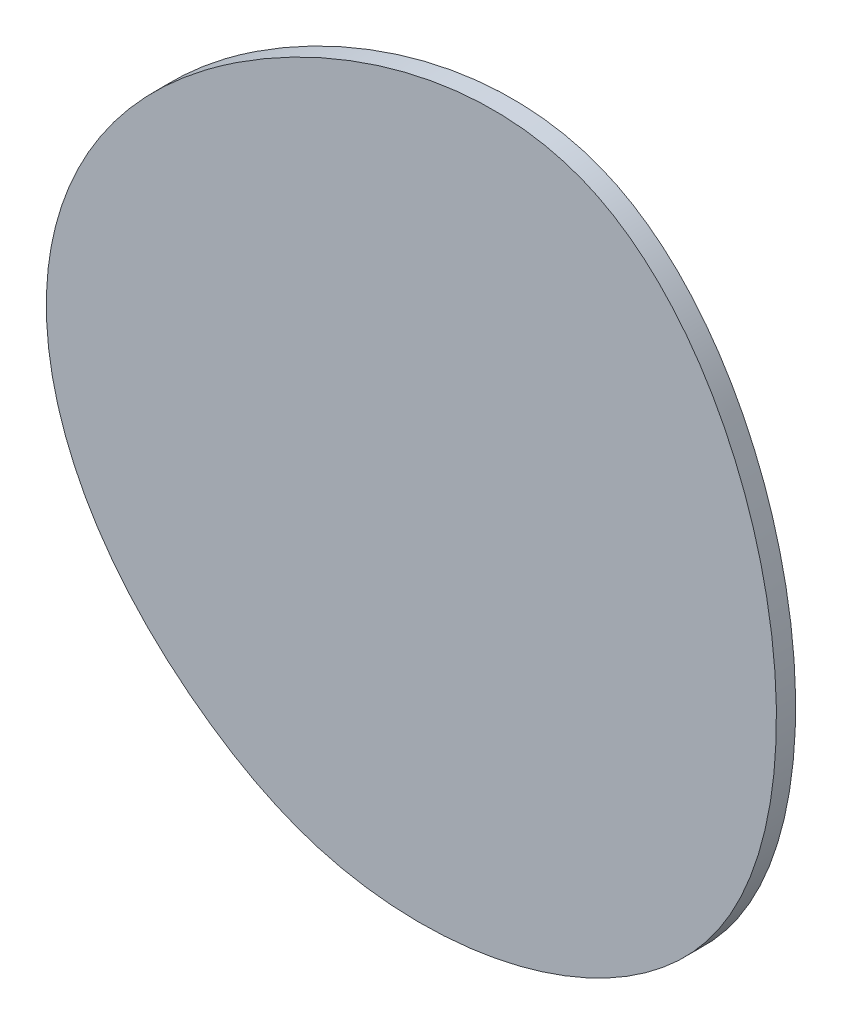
from build123d import *

# Parameters (mm, degrees)
BOSS_EXTRU_1_DEPTH = 0.3


with BuildPart() as part:
    # Esquisse1 → Boss.-Extru.1 (new body)
    with BuildSketch(Plane.XY):
        with BuildLine():
            add(Edge.make_bspline(
                [(-2.897357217, 4.499623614), (-1.235321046, 5.76027652), (5.082118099, 8.145387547), (7.795515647, -4.067480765), (0.01472293, -6.012216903), (-6.15082446, -2.467694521), (-6.233834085, 1.968908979), (-2.897357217, 4.499623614)],
                knots=[0, 0, 0, 0, 0.169256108, 0.426411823, 0.602865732, 0.66022455, 1, 1, 1, 1], degree=3))
        make_face()
    extrude(amount=BOSS_EXTRU_1_DEPTH)


solid = part.part
